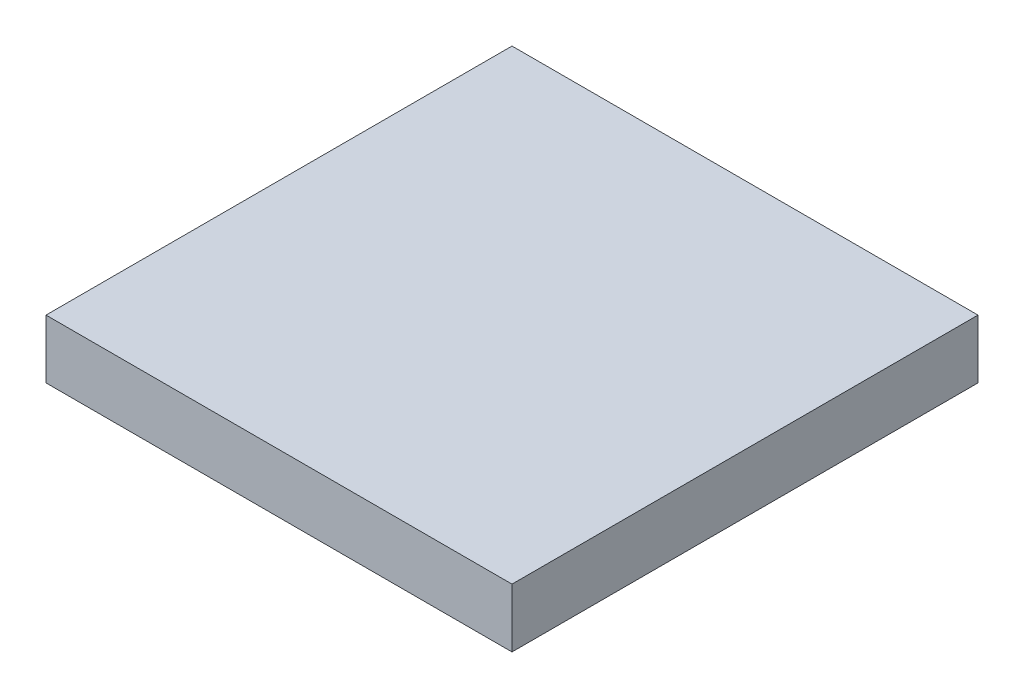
ISO-10303-21;
HEADER;
FILE_DESCRIPTION(('STEP AP214'),'2;1');
FILE_NAME('part.step','',(''),(''),'','','');
FILE_SCHEMA(('AUTOMOTIVE_DESIGN { 1 0 10303 214 1 1 1 1 }'));
ENDSEC;
DATA;
#1=APPLICATION_CONTEXT('core data for automotive mechanical design processes');
#2=APPLICATION_PROTOCOL_DEFINITION('international standard','automotive_design',2000,#1);
#3=PRODUCT_CONTEXT('',#1,'mechanical');
#4=PRODUCT('Part','Part','',(#3));
#5=PRODUCT_RELATED_PRODUCT_CATEGORY('part','',(#4));
#6=PRODUCT_DEFINITION_FORMATION('','',#4);
#7=PRODUCT_DEFINITION_CONTEXT('part definition',#1,'design');
#8=PRODUCT_DEFINITION('design','',#6,#7);
#9=PRODUCT_DEFINITION_SHAPE('','',#8);
#10=(LENGTH_UNIT() NAMED_UNIT(*) SI_UNIT(.MILLI.,.METRE.));
#11=(NAMED_UNIT(*) PLANE_ANGLE_UNIT() SI_UNIT($,.RADIAN.));
#12=(NAMED_UNIT(*) SI_UNIT($,.STERADIAN.) SOLID_ANGLE_UNIT());
#13=UNCERTAINTY_MEASURE_WITH_UNIT(LENGTH_MEASURE(1.E-05),#10,'distance_accuracy_value','');
#14=(GEOMETRIC_REPRESENTATION_CONTEXT(3) GLOBAL_UNCERTAINTY_ASSIGNED_CONTEXT((#13)) GLOBAL_UNIT_ASSIGNED_CONTEXT((#10,
#11,#12)) REPRESENTATION_CONTEXT('',''));
#15=CARTESIAN_POINT('',(0.,0.,0.));
#16=DIRECTION('',(0.,0.,1.));
#17=DIRECTION('',(1.,0.,0.));
#18=AXIS2_PLACEMENT_3D('',#15,#16,#17);
#19=CARTESIAN_POINT('',(0.,0.,50.));
#20=DIRECTION('',(1.,0.,0.));
#21=DIRECTION('',(0.,0.,-1.));
#22=AXIS2_PLACEMENT_3D('',#19,#20,#21);
#23=PLANE('',#22);
#24=DIRECTION('',(0.,-1.,0.));
#25=VECTOR('',#24,1.);
#26=CARTESIAN_POINT('',(0.,0.,-50.));
#27=LINE('',#26,#25);
#28=CARTESIAN_POINT('',(0.,12.6090257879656,-50.));
#29=VERTEX_POINT('',#28);
#30=CARTESIAN_POINT('',(0.,0.,-50.));
#31=VERTEX_POINT('',#30);
#32=EDGE_CURVE('E96',#29,#31,#27,.T.);
#33=ORIENTED_EDGE('',*,*,#32,.T.);
#34=DIRECTION('',(0.,0.,-1.));
#35=VECTOR('',#34,1.);
#36=CARTESIAN_POINT('',(0.,0.,50.));
#37=LINE('',#36,#35);
#38=CARTESIAN_POINT('',(0.,0.,50.));
#39=VERTEX_POINT('',#38);
#40=EDGE_CURVE('E11',#39,#31,#37,.T.);
#41=ORIENTED_EDGE('',*,*,#40,.F.);
#42=DIRECTION('',(0.,-1.,0.));
#43=VECTOR('',#42,1.);
#44=CARTESIAN_POINT('',(0.,0.,50.));
#45=LINE('',#44,#43);
#46=CARTESIAN_POINT('',(0.,12.6090257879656,50.));
#47=VERTEX_POINT('',#46);
#48=EDGE_CURVE('E84',#47,#39,#45,.T.);
#49=ORIENTED_EDGE('',*,*,#48,.F.);
#50=DIRECTION('',(0.,0.,-1.));
#51=VECTOR('',#50,1.);
#52=CARTESIAN_POINT('',(0.,12.6090257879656,50.));
#53=LINE('',#52,#51);
#54=EDGE_CURVE('E92',#47,#29,#53,.T.);
#55=ORIENTED_EDGE('',*,*,#54,.T.);
#56=EDGE_LOOP('',(#33,#41,#49,#55));
#57=FACE_BOUND('',#56,.T.);
#58=ADVANCED_FACE('F33',(#57),#23,.F.);
#59=CARTESIAN_POINT('',(0.,0.,50.));
#60=DIRECTION('',(0.,1.,0.));
#61=DIRECTION('',(0.,0.,1.));
#62=AXIS2_PLACEMENT_3D('',#59,#60,#61);
#63=PLANE('',#62);
#64=DIRECTION('',(1.,0.,0.));
#65=VECTOR('',#64,1.);
#66=CARTESIAN_POINT('',(0.,0.,-50.));
#67=LINE('',#66,#65);
#68=CARTESIAN_POINT('',(100.,0.,-50.));
#69=VERTEX_POINT('',#68);
#70=EDGE_CURVE('E88',#31,#69,#67,.T.);
#71=ORIENTED_EDGE('',*,*,#70,.T.);
#72=DIRECTION('',(0.,0.,-1.));
#73=VECTOR('',#72,1.);
#74=CARTESIAN_POINT('',(100.,0.,50.));
#75=LINE('',#74,#73);
#76=CARTESIAN_POINT('',(100.,0.,50.));
#77=VERTEX_POINT('',#76);
#78=EDGE_CURVE('E41',#77,#69,#75,.T.);
#79=ORIENTED_EDGE('',*,*,#78,.F.);
#80=DIRECTION('',(1.,0.,0.));
#81=VECTOR('',#80,1.);
#82=CARTESIAN_POINT('',(0.,0.,50.));
#83=LINE('',#82,#81);
#84=EDGE_CURVE('E79',#39,#77,#83,.T.);
#85=ORIENTED_EDGE('',*,*,#84,.F.);
#86=ORIENTED_EDGE('',*,*,#40,.T.);
#87=EDGE_LOOP('',(#71,#79,#85,#86));
#88=FACE_BOUND('',#87,.T.);
#89=ADVANCED_FACE('F87',(#88),#63,.F.);
#90=CARTESIAN_POINT('',(100.,0.,50.));
#91=DIRECTION('',(-1.,0.,0.));
#92=DIRECTION('',(0.,0.,1.));
#93=AXIS2_PLACEMENT_3D('',#90,#91,#92);
#94=PLANE('',#93);
#95=DIRECTION('',(0.,1.,0.));
#96=VECTOR('',#95,1.);
#97=CARTESIAN_POINT('',(100.,0.,-50.));
#98=LINE('',#97,#96);
#99=CARTESIAN_POINT('',(100.,12.6090257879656,-50.));
#100=VERTEX_POINT('',#99);
#101=EDGE_CURVE('E66',#69,#100,#98,.T.);
#102=ORIENTED_EDGE('',*,*,#101,.T.);
#103=DIRECTION('',(0.,0.,-1.));
#104=VECTOR('',#103,1.);
#105=CARTESIAN_POINT('',(100.,12.6090257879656,50.));
#106=LINE('',#105,#104);
#107=CARTESIAN_POINT('',(100.,12.6090257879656,50.));
#108=VERTEX_POINT('',#107);
#109=EDGE_CURVE('E89',#108,#100,#106,.T.);
#110=ORIENTED_EDGE('',*,*,#109,.F.);
#111=DIRECTION('',(0.,1.,0.));
#112=VECTOR('',#111,1.);
#113=CARTESIAN_POINT('',(100.,0.,50.));
#114=LINE('',#113,#112);
#115=EDGE_CURVE('E82',#77,#108,#114,.T.);
#116=ORIENTED_EDGE('',*,*,#115,.F.);
#117=ORIENTED_EDGE('',*,*,#78,.T.);
#118=EDGE_LOOP('',(#102,#110,#116,#117));
#119=FACE_BOUND('',#118,.T.);
#120=ADVANCED_FACE('F90',(#119),#94,.F.);
#121=CARTESIAN_POINT('',(0.,12.6090257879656,50.));
#122=DIRECTION('',(0.,-1.,0.));
#123=DIRECTION('',(0.,0.,-1.));
#124=AXIS2_PLACEMENT_3D('',#121,#122,#123);
#125=PLANE('',#124);
#126=DIRECTION('',(-1.,0.,0.));
#127=VECTOR('',#126,1.);
#128=CARTESIAN_POINT('',(0.,12.6090257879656,-50.));
#129=LINE('',#128,#127);
#130=EDGE_CURVE('E72',#100,#29,#129,.T.);
#131=ORIENTED_EDGE('',*,*,#130,.T.);
#132=ORIENTED_EDGE('',*,*,#54,.F.);
#133=DIRECTION('',(-1.,0.,0.));
#134=VECTOR('',#133,1.);
#135=CARTESIAN_POINT('',(0.,12.6090257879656,50.));
#136=LINE('',#135,#134);
#137=EDGE_CURVE('E49',#108,#47,#136,.T.);
#138=ORIENTED_EDGE('',*,*,#137,.F.);
#139=ORIENTED_EDGE('',*,*,#109,.T.);
#140=EDGE_LOOP('',(#131,#132,#138,#139));
#141=FACE_BOUND('',#140,.T.);
#142=ADVANCED_FACE('F103',(#141),#125,.F.);
#143=CARTESIAN_POINT('',(0.,12.6090257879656,50.));
#144=DIRECTION('',(0.,0.,-1.));
#145=DIRECTION('',(-1.,0.,0.));
#146=AXIS2_PLACEMENT_3D('',#143,#144,#145);
#147=PLANE('',#146);
#148=ORIENTED_EDGE('',*,*,#48,.T.);
#149=ORIENTED_EDGE('',*,*,#84,.T.);
#150=ORIENTED_EDGE('',*,*,#115,.T.);
#151=ORIENTED_EDGE('',*,*,#137,.T.);
#152=EDGE_LOOP('',(#148,#149,#150,#151));
#153=FACE_BOUND('',#152,.T.);
#154=ADVANCED_FACE('F80',(#153),#147,.F.);
#155=CARTESIAN_POINT('',(0.,12.6090257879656,-50.));
#156=DIRECTION('',(0.,0.,-1.));
#157=DIRECTION('',(-1.,0.,0.));
#158=AXIS2_PLACEMENT_3D('',#155,#156,#157);
#159=PLANE('',#158);
#160=ORIENTED_EDGE('',*,*,#32,.F.);
#161=ORIENTED_EDGE('',*,*,#130,.F.);
#162=ORIENTED_EDGE('',*,*,#101,.F.);
#163=ORIENTED_EDGE('',*,*,#70,.F.);
#164=EDGE_LOOP('',(#160,#161,#162,#163));
#165=FACE_BOUND('',#164,.T.);
#166=ADVANCED_FACE('F106',(#165),#159,.T.);
#167=CLOSED_SHELL('',(#58,#89,#120,#142,#154,#166));
#168=MANIFOLD_SOLID_BREP('B2',#167);
#169=ADVANCED_BREP_SHAPE_REPRESENTATION('',(#18,#168),#14);
#170=SHAPE_DEFINITION_REPRESENTATION(#9,#169);
ENDSEC;
END-ISO-10303-21;
